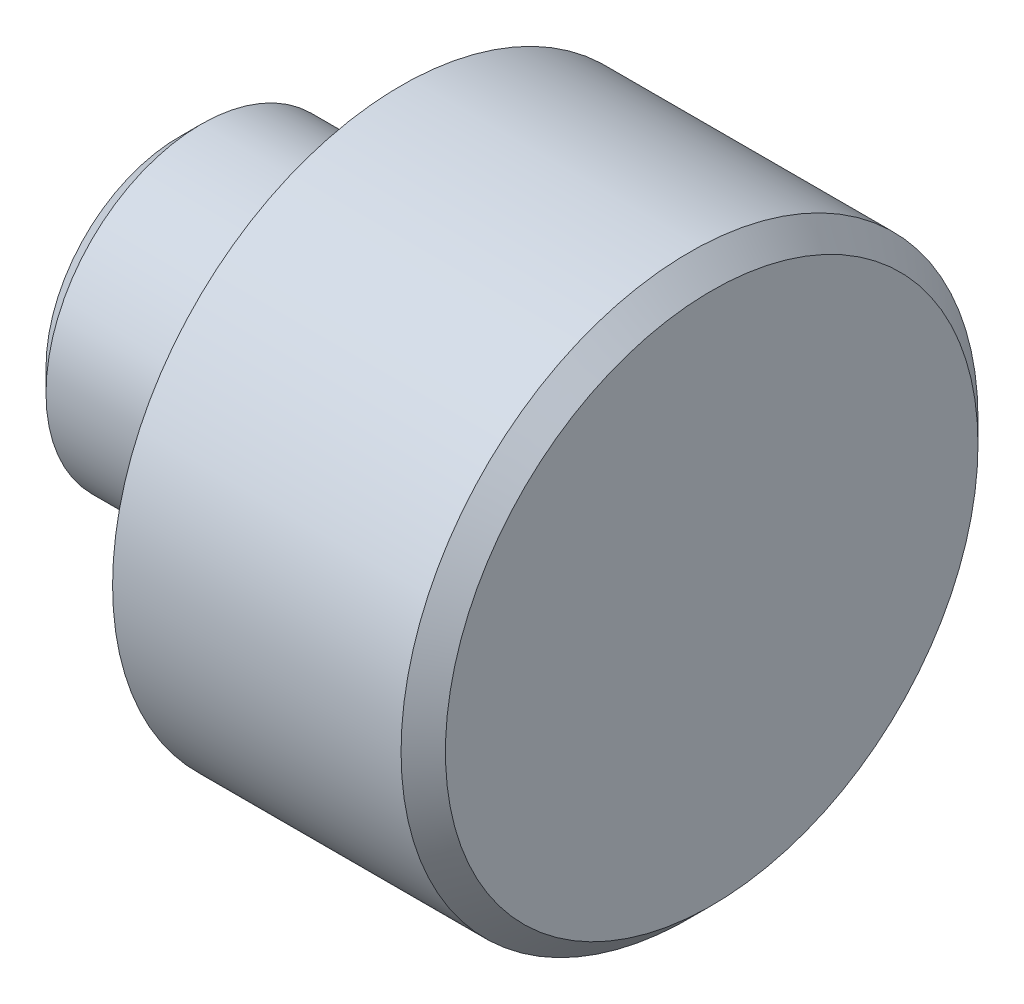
ISO-10303-21;
HEADER;
FILE_DESCRIPTION(('STEP AP214'),'2;1');
FILE_NAME('part.step','',(''),(''),'','','');
FILE_SCHEMA(('AUTOMOTIVE_DESIGN { 1 0 10303 214 1 1 1 1 }'));
ENDSEC;
DATA;
#1=APPLICATION_CONTEXT('core data for automotive mechanical design processes');
#2=APPLICATION_PROTOCOL_DEFINITION('international standard','automotive_design',2000,#1);
#3=PRODUCT_CONTEXT('',#1,'mechanical');
#4=PRODUCT('Part','Part','',(#3));
#5=PRODUCT_RELATED_PRODUCT_CATEGORY('part','',(#4));
#6=PRODUCT_DEFINITION_FORMATION('','',#4);
#7=PRODUCT_DEFINITION_CONTEXT('part definition',#1,'design');
#8=PRODUCT_DEFINITION('design','',#6,#7);
#9=PRODUCT_DEFINITION_SHAPE('','',#8);
#10=(LENGTH_UNIT() NAMED_UNIT(*) SI_UNIT(.MILLI.,.METRE.));
#11=(NAMED_UNIT(*) PLANE_ANGLE_UNIT() SI_UNIT($,.RADIAN.));
#12=(NAMED_UNIT(*) SI_UNIT($,.STERADIAN.) SOLID_ANGLE_UNIT());
#13=UNCERTAINTY_MEASURE_WITH_UNIT(LENGTH_MEASURE(1.E-05),#10,'distance_accuracy_value','');
#14=(GEOMETRIC_REPRESENTATION_CONTEXT(3) GLOBAL_UNCERTAINTY_ASSIGNED_CONTEXT((#13)) GLOBAL_UNIT_ASSIGNED_CONTEXT((#10,
#11,#12)) REPRESENTATION_CONTEXT('',''));
#15=CARTESIAN_POINT('',(0.,0.,0.));
#16=DIRECTION('',(0.,0.,1.));
#17=DIRECTION('',(1.,0.,0.));
#18=AXIS2_PLACEMENT_3D('',#15,#16,#17);
#19=CARTESIAN_POINT('',(0.,0.,0.));
#20=DIRECTION('',(1.,0.,0.));
#21=DIRECTION('',(0.,0.,-1.));
#22=AXIS2_PLACEMENT_3D('',#19,#20,#21);
#23=PLANE('',#22);
#24=CARTESIAN_POINT('',(0.,0.,0.));
#25=DIRECTION('',(1.,0.,0.));
#26=DIRECTION('',(0.,0.,-1.));
#27=AXIS2_PLACEMENT_3D('',#24,#25,#26);
#28=CIRCLE('',#27,6.5);
#29=CARTESIAN_POINT('',(0.,0.,-6.5));
#30=VERTEX_POINT('',#29);
#31=EDGE_CURVE('E54',#30,#30,#28,.T.);
#32=ORIENTED_EDGE('',*,*,#31,.F.);
#33=EDGE_LOOP('',(#32));
#34=FACE_BOUND('',#33,.T.);
#35=CARTESIAN_POINT('',(0.,0.,0.));
#36=DIRECTION('',(1.,0.,0.));
#37=DIRECTION('',(0.,0.,-1.));
#38=AXIS2_PLACEMENT_3D('',#35,#36,#37);
#39=CIRCLE('',#38,3.5);
#40=CARTESIAN_POINT('',(0.,0.,-3.5));
#41=VERTEX_POINT('',#40);
#42=EDGE_CURVE('E51',#41,#41,#39,.F.);
#43=ORIENTED_EDGE('',*,*,#42,.F.);
#44=EDGE_LOOP('',(#43));
#45=FACE_BOUND('',#44,.T.);
#46=ADVANCED_FACE('F31',(#34,#45),#23,.F.);
#47=CARTESIAN_POINT('',(7.,0.,0.));
#48=DIRECTION('',(-1.,0.,0.));
#49=DIRECTION('',(0.,0.,1.));
#50=AXIS2_PLACEMENT_3D('',#47,#48,#49);
#51=CYLINDRICAL_SURFACE('',#50,6.5);
#52=CARTESIAN_POINT('',(6.5,0.,0.));
#53=DIRECTION('',(1.,0.,0.));
#54=DIRECTION('',(0.,0.,-1.));
#55=AXIS2_PLACEMENT_3D('',#52,#53,#54);
#56=CIRCLE('',#55,6.5);
#57=CARTESIAN_POINT('',(6.5,0.,-6.5));
#58=VERTEX_POINT('',#57);
#59=EDGE_CURVE('E10',#58,#58,#56,.F.);
#60=ORIENTED_EDGE('',*,*,#59,.T.);
#61=EDGE_LOOP('',(#60));
#62=FACE_BOUND('',#61,.T.);
#63=ORIENTED_EDGE('',*,*,#31,.T.);
#64=EDGE_LOOP('',(#63));
#65=FACE_BOUND('',#64,.T.);
#66=ADVANCED_FACE('F58',(#62,#65),#51,.T.);
#67=CARTESIAN_POINT('',(7.,0.,0.));
#68=DIRECTION('',(1.,0.,0.));
#69=DIRECTION('',(0.,0.,-1.));
#70=AXIS2_PLACEMENT_3D('',#67,#68,#69);
#71=PLANE('',#70);
#72=CARTESIAN_POINT('',(7.,0.,0.));
#73=DIRECTION('',(1.,0.,0.));
#74=DIRECTION('',(0.,0.,-1.));
#75=AXIS2_PLACEMENT_3D('',#72,#73,#74);
#76=CIRCLE('',#75,6.);
#77=CARTESIAN_POINT('',(7.,0.,-6.));
#78=VERTEX_POINT('',#77);
#79=EDGE_CURVE('E38',#78,#78,#76,.T.);
#80=ORIENTED_EDGE('',*,*,#79,.T.);
#81=EDGE_LOOP('',(#80));
#82=FACE_BOUND('',#81,.T.);
#83=ADVANCED_FACE('F68',(#82),#71,.T.);
#84=CARTESIAN_POINT('',(-5.,0.,0.));
#85=DIRECTION('',(1.,0.,0.));
#86=DIRECTION('',(0.,0.,-1.));
#87=AXIS2_PLACEMENT_3D('',#84,#85,#86);
#88=CYLINDRICAL_SURFACE('',#87,3.5);
#89=CARTESIAN_POINT('',(-4.5,0.,0.));
#90=DIRECTION('',(-1.,0.,0.));
#91=DIRECTION('',(0.,0.,1.));
#92=AXIS2_PLACEMENT_3D('',#89,#90,#91);
#93=CIRCLE('',#92,3.5);
#94=CARTESIAN_POINT('',(-4.5,0.,3.5));
#95=VERTEX_POINT('',#94);
#96=EDGE_CURVE('E42',#95,#95,#93,.F.);
#97=ORIENTED_EDGE('',*,*,#96,.T.);
#98=EDGE_LOOP('',(#97));
#99=FACE_BOUND('',#98,.T.);
#100=ORIENTED_EDGE('',*,*,#42,.T.);
#101=EDGE_LOOP('',(#100));
#102=FACE_BOUND('',#101,.T.);
#103=ADVANCED_FACE('F65',(#99,#102),#88,.T.);
#104=CARTESIAN_POINT('',(-5.,0.,0.));
#105=DIRECTION('',(-1.,0.,0.));
#106=DIRECTION('',(0.,0.,1.));
#107=AXIS2_PLACEMENT_3D('',#104,#105,#106);
#108=PLANE('',#107);
#109=CARTESIAN_POINT('',(-5.,0.,0.));
#110=DIRECTION('',(-1.,0.,0.));
#111=DIRECTION('',(0.,0.,1.));
#112=AXIS2_PLACEMENT_3D('',#109,#110,#111);
#113=CIRCLE('',#112,3.);
#114=CARTESIAN_POINT('',(-5.,0.,3.));
#115=VERTEX_POINT('',#114);
#116=EDGE_CURVE('E46',#115,#115,#113,.T.);
#117=ORIENTED_EDGE('',*,*,#116,.T.);
#118=EDGE_LOOP('',(#117));
#119=FACE_BOUND('',#118,.T.);
#120=ADVANCED_FACE('F67',(#119),#108,.T.);
#121=CARTESIAN_POINT('',(-5.,0.,0.));
#122=DIRECTION('',(1.,0.,0.));
#123=DIRECTION('',(0.,0.,-1.));
#124=AXIS2_PLACEMENT_3D('',#121,#122,#123);
#125=CONICAL_SURFACE('',#124,3.,0.785398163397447);
#126=ORIENTED_EDGE('',*,*,#96,.F.);
#127=EDGE_LOOP('',(#126));
#128=FACE_BOUND('',#127,.T.);
#129=ORIENTED_EDGE('',*,*,#116,.F.);
#130=EDGE_LOOP('',(#129));
#131=FACE_BOUND('',#130,.T.);
#132=ADVANCED_FACE('F75',(#128,#131),#125,.T.);
#133=CARTESIAN_POINT('',(7.,0.,0.));
#134=DIRECTION('',(-1.,0.,0.));
#135=DIRECTION('',(0.,0.,1.));
#136=AXIS2_PLACEMENT_3D('',#133,#134,#135);
#137=CONICAL_SURFACE('',#136,6.,0.785398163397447);
#138=ORIENTED_EDGE('',*,*,#59,.F.);
#139=EDGE_LOOP('',(#138));
#140=FACE_BOUND('',#139,.T.);
#141=ORIENTED_EDGE('',*,*,#79,.F.);
#142=EDGE_LOOP('',(#141));
#143=FACE_BOUND('',#142,.T.);
#144=ADVANCED_FACE('F33',(#140,#143),#137,.T.);
#145=CLOSED_SHELL('',(#46,#66,#83,#103,#120,#132,#144));
#146=MANIFOLD_SOLID_BREP('B2',#145);
#147=ADVANCED_BREP_SHAPE_REPRESENTATION('',(#18,#146),#14);
#148=SHAPE_DEFINITION_REPRESENTATION(#9,#147);
ENDSEC;
END-ISO-10303-21;
